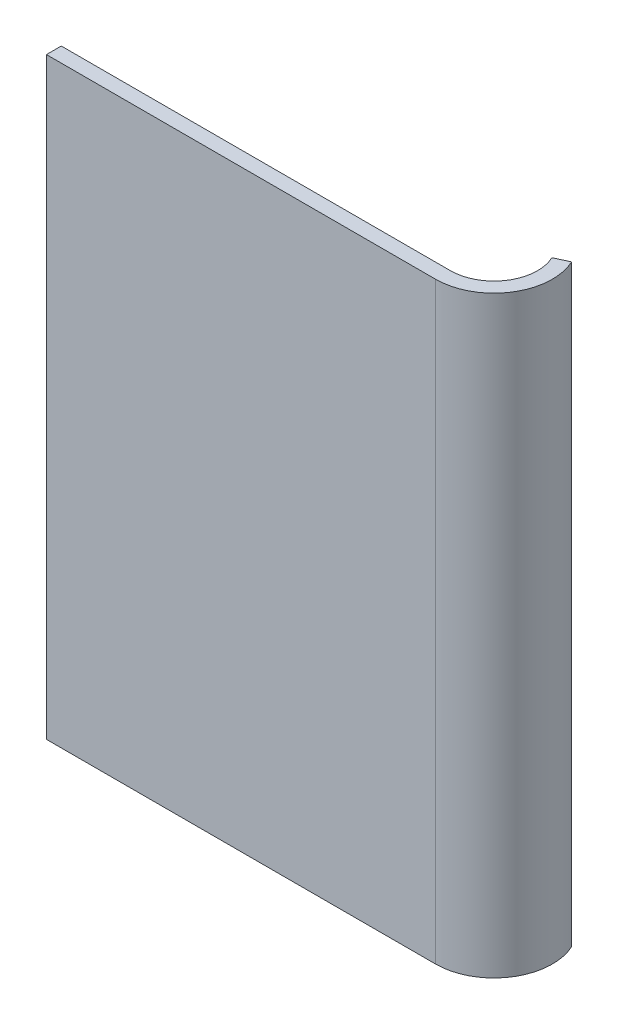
from build123d import *

# Parameters (mm, degrees)
BOSS_EXTRUDE1_DEPTH = 1524


with BuildPart() as part:
    # Sketch1 → Boss-Extrude1 (new body)
    with BuildSketch(Plane(origin=(0, 0, 0), x_dir=(1, 0, 0), z_dir=(0, 1, 0))):
        with BuildLine():
            Line((0, 0), (1000, 0))
            ThreePointArc((1000, 0), (1126.508716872, 69.405058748), (1135.946168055, 213.392739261))
            Line((1135.946168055, 213.392739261), (1101.415841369, 197.290983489))
            ThreePointArc((1101.415841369, 197.290983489), (1094.375502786, 89.876173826), (1000, 38.1))
            Line((1000, 38.1), (0, 38.1))
            Line((0, 38.1), (0, 0))
        make_face()
    extrude(amount=BOSS_EXTRUDE1_DEPTH)


solid = part.part
